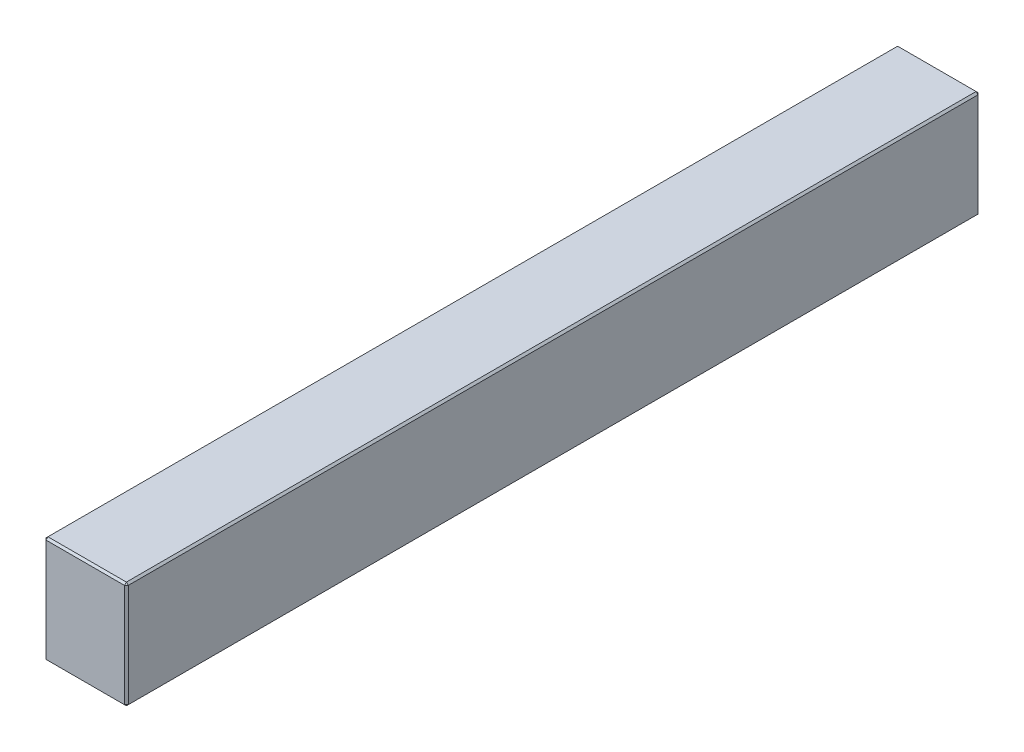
ISO-10303-21;
HEADER;
FILE_DESCRIPTION(('STEP AP214'),'2;1');
FILE_NAME('part.step','',(''),(''),'','','');
FILE_SCHEMA(('AUTOMOTIVE_DESIGN { 1 0 10303 214 1 1 1 1 }'));
ENDSEC;
DATA;
#1=APPLICATION_CONTEXT('core data for automotive mechanical design processes');
#2=APPLICATION_PROTOCOL_DEFINITION('international standard','automotive_design',2000,#1);
#3=PRODUCT_CONTEXT('',#1,'mechanical');
#4=PRODUCT('Part','Part','',(#3));
#5=PRODUCT_RELATED_PRODUCT_CATEGORY('part','',(#4));
#6=PRODUCT_DEFINITION_FORMATION('','',#4);
#7=PRODUCT_DEFINITION_CONTEXT('part definition',#1,'design');
#8=PRODUCT_DEFINITION('design','',#6,#7);
#9=PRODUCT_DEFINITION_SHAPE('','',#8);
#10=(LENGTH_UNIT() NAMED_UNIT(*) SI_UNIT(.MILLI.,.METRE.));
#11=(NAMED_UNIT(*) PLANE_ANGLE_UNIT() SI_UNIT($,.RADIAN.));
#12=(NAMED_UNIT(*) SI_UNIT($,.STERADIAN.) SOLID_ANGLE_UNIT());
#13=UNCERTAINTY_MEASURE_WITH_UNIT(LENGTH_MEASURE(1.E-05),#10,'distance_accuracy_value','');
#14=(GEOMETRIC_REPRESENTATION_CONTEXT(3) GLOBAL_UNCERTAINTY_ASSIGNED_CONTEXT((#13)) GLOBAL_UNIT_ASSIGNED_CONTEXT((#10,
#11,#12)) REPRESENTATION_CONTEXT('',''));
#15=CARTESIAN_POINT('',(0.,0.,0.));
#16=DIRECTION('',(0.,0.,1.));
#17=DIRECTION('',(1.,0.,0.));
#18=AXIS2_PLACEMENT_3D('',#15,#16,#17);
#19=CARTESIAN_POINT('',(-21.5,56.,223.));
#20=DIRECTION('',(1.,0.,0.));
#21=DIRECTION('',(0.,0.,-1.));
#22=AXIS2_PLACEMENT_3D('',#19,#20,#21);
#23=PLANE('',#22);
#24=DIRECTION('',(0.,-1.,0.));
#25=VECTOR('',#24,1.);
#26=CARTESIAN_POINT('',(-21.5,56.,-222.));
#27=LINE('',#26,#25);
#28=CARTESIAN_POINT('',(-21.5,55.,-222.));
#29=VERTEX_POINT('',#28);
#30=CARTESIAN_POINT('',(-21.5,1.,-222.));
#31=VERTEX_POINT('',#30);
#32=EDGE_CURVE('E114',#29,#31,#27,.T.);
#33=ORIENTED_EDGE('',*,*,#32,.T.);
#34=DIRECTION('',(0.,0.,1.));
#35=VECTOR('',#34,1.);
#36=CARTESIAN_POINT('',(-21.5,1.,223.));
#37=LINE('',#36,#35);
#38=CARTESIAN_POINT('',(-21.5,1.,222.));
#39=VERTEX_POINT('',#38);
#40=EDGE_CURVE('E110',#31,#39,#37,.T.);
#41=ORIENTED_EDGE('',*,*,#40,.T.);
#42=DIRECTION('',(0.,1.,0.));
#43=VECTOR('',#42,1.);
#44=CARTESIAN_POINT('',(-21.5,56.,222.));
#45=LINE('',#44,#43);
#46=CARTESIAN_POINT('',(-21.5,55.,222.));
#47=VERTEX_POINT('',#46);
#48=EDGE_CURVE('E103',#39,#47,#45,.T.);
#49=ORIENTED_EDGE('',*,*,#48,.T.);
#50=DIRECTION('',(0.,0.,-1.));
#51=VECTOR('',#50,1.);
#52=CARTESIAN_POINT('',(-21.5,55.,-223.));
#53=LINE('',#52,#51);
#54=EDGE_CURVE('E107',#47,#29,#53,.T.);
#55=ORIENTED_EDGE('',*,*,#54,.T.);
#56=EDGE_LOOP('',(#33,#41,#49,#55));
#57=FACE_BOUND('',#56,.T.);
#58=ADVANCED_FACE('F15',(#57),#23,.F.);
#59=CARTESIAN_POINT('',(21.5,56.,223.));
#60=DIRECTION('',(0.,0.,-1.));
#61=DIRECTION('',(-1.,0.,0.));
#62=AXIS2_PLACEMENT_3D('',#59,#60,#61);
#63=PLANE('',#62);
#64=DIRECTION('',(-1.,0.,0.));
#65=VECTOR('',#64,1.);
#66=CARTESIAN_POINT('',(-21.5,55.,223.));
#67=LINE('',#66,#65);
#68=CARTESIAN_POINT('',(20.5,55.,223.));
#69=VERTEX_POINT('',#68);
#70=CARTESIAN_POINT('',(-20.5,55.,223.));
#71=VERTEX_POINT('',#70);
#72=EDGE_CURVE('E164',#69,#71,#67,.T.);
#73=ORIENTED_EDGE('',*,*,#72,.T.);
#74=DIRECTION('',(0.,-1.,0.));
#75=VECTOR('',#74,1.);
#76=CARTESIAN_POINT('',(-20.5,56.,223.));
#77=LINE('',#76,#75);
#78=CARTESIAN_POINT('',(-20.5,1.,223.));
#79=VERTEX_POINT('',#78);
#80=EDGE_CURVE('E122',#71,#79,#77,.T.);
#81=ORIENTED_EDGE('',*,*,#80,.T.);
#82=DIRECTION('',(1.,0.,0.));
#83=VECTOR('',#82,1.);
#84=CARTESIAN_POINT('',(21.5,1.,223.));
#85=LINE('',#84,#83);
#86=CARTESIAN_POINT('',(20.5,1.,223.));
#87=VERTEX_POINT('',#86);
#88=EDGE_CURVE('E168',#79,#87,#85,.T.);
#89=ORIENTED_EDGE('',*,*,#88,.T.);
#90=DIRECTION('',(0.,1.,0.));
#91=VECTOR('',#90,1.);
#92=CARTESIAN_POINT('',(20.5,56.,223.));
#93=LINE('',#92,#91);
#94=EDGE_CURVE('E166',#87,#69,#93,.T.);
#95=ORIENTED_EDGE('',*,*,#94,.T.);
#96=EDGE_LOOP('',(#73,#81,#89,#95));
#97=FACE_BOUND('',#96,.T.);
#98=ADVANCED_FACE('F275',(#97),#63,.F.);
#99=CARTESIAN_POINT('',(21.5,56.,223.));
#100=DIRECTION('',(-1.,0.,0.));
#101=DIRECTION('',(0.,0.,1.));
#102=AXIS2_PLACEMENT_3D('',#99,#100,#101);
#103=PLANE('',#102);
#104=DIRECTION('',(0.,0.,-1.));
#105=VECTOR('',#104,1.);
#106=CARTESIAN_POINT('',(21.5,1.,223.));
#107=LINE('',#106,#105);
#108=CARTESIAN_POINT('',(21.5,1.,222.));
#109=VERTEX_POINT('',#108);
#110=CARTESIAN_POINT('',(21.5,1.,-222.));
#111=VERTEX_POINT('',#110);
#112=EDGE_CURVE('E159',#109,#111,#107,.T.);
#113=ORIENTED_EDGE('',*,*,#112,.T.);
#114=DIRECTION('',(0.,1.,0.));
#115=VECTOR('',#114,1.);
#116=CARTESIAN_POINT('',(21.5,56.,-222.));
#117=LINE('',#116,#115);
#118=CARTESIAN_POINT('',(21.5,55.,-222.));
#119=VERTEX_POINT('',#118);
#120=EDGE_CURVE('E161',#111,#119,#117,.T.);
#121=ORIENTED_EDGE('',*,*,#120,.T.);
#122=DIRECTION('',(0.,0.,1.));
#123=VECTOR('',#122,1.);
#124=CARTESIAN_POINT('',(21.5,55.,223.));
#125=LINE('',#124,#123);
#126=CARTESIAN_POINT('',(21.5,55.,222.));
#127=VERTEX_POINT('',#126);
#128=EDGE_CURVE('E155',#119,#127,#125,.T.);
#129=ORIENTED_EDGE('',*,*,#128,.T.);
#130=DIRECTION('',(0.,-1.,0.));
#131=VECTOR('',#130,1.);
#132=CARTESIAN_POINT('',(21.5,56.,222.));
#133=LINE('',#132,#131);
#134=EDGE_CURVE('E157',#127,#109,#133,.T.);
#135=ORIENTED_EDGE('',*,*,#134,.T.);
#136=EDGE_LOOP('',(#113,#121,#129,#135));
#137=FACE_BOUND('',#136,.T.);
#138=ADVANCED_FACE('F254',(#137),#103,.F.);
#139=CARTESIAN_POINT('',(21.5,56.,-223.));
#140=DIRECTION('',(0.,0.,1.));
#141=DIRECTION('',(1.,0.,0.));
#142=AXIS2_PLACEMENT_3D('',#139,#140,#141);
#143=PLANE('',#142);
#144=DIRECTION('',(0.,-1.,0.));
#145=VECTOR('',#144,1.);
#146=CARTESIAN_POINT('',(20.5,56.,-223.));
#147=LINE('',#146,#145);
#148=CARTESIAN_POINT('',(20.5,55.,-223.));
#149=VERTEX_POINT('',#148);
#150=CARTESIAN_POINT('',(20.5,1.,-223.));
#151=VERTEX_POINT('',#150);
#152=EDGE_CURVE('E148',#149,#151,#147,.T.);
#153=ORIENTED_EDGE('',*,*,#152,.T.);
#154=DIRECTION('',(-1.,0.,0.));
#155=VECTOR('',#154,1.);
#156=CARTESIAN_POINT('',(21.5,1.,-223.));
#157=LINE('',#156,#155);
#158=CARTESIAN_POINT('',(-20.5,1.,-223.));
#159=VERTEX_POINT('',#158);
#160=EDGE_CURVE('E153',#151,#159,#157,.T.);
#161=ORIENTED_EDGE('',*,*,#160,.T.);
#162=DIRECTION('',(0.,1.,0.));
#163=VECTOR('',#162,1.);
#164=CARTESIAN_POINT('',(-20.5,56.,-223.));
#165=LINE('',#164,#163);
#166=CARTESIAN_POINT('',(-20.5,55.,-223.));
#167=VERTEX_POINT('',#166);
#168=EDGE_CURVE('E150',#159,#167,#165,.T.);
#169=ORIENTED_EDGE('',*,*,#168,.T.);
#170=DIRECTION('',(1.,0.,0.));
#171=VECTOR('',#170,1.);
#172=CARTESIAN_POINT('',(21.5,55.,-223.));
#173=LINE('',#172,#171);
#174=EDGE_CURVE('E146',#167,#149,#173,.T.);
#175=ORIENTED_EDGE('',*,*,#174,.T.);
#176=EDGE_LOOP('',(#153,#161,#169,#175));
#177=FACE_BOUND('',#176,.T.);
#178=ADVANCED_FACE('F284',(#177),#143,.F.);
#179=CARTESIAN_POINT('',(0.,56.,0.));
#180=DIRECTION('',(0.,1.,0.));
#181=DIRECTION('',(0.,0.,1.));
#182=AXIS2_PLACEMENT_3D('',#179,#180,#181);
#183=PLANE('',#182);
#184=DIRECTION('',(0.,0.,-1.));
#185=VECTOR('',#184,1.);
#186=CARTESIAN_POINT('',(20.5,56.,-223.));
#187=LINE('',#186,#185);
#188=CARTESIAN_POINT('',(20.5,56.,222.));
#189=VERTEX_POINT('',#188);
#190=CARTESIAN_POINT('',(20.5,56.,-222.));
#191=VERTEX_POINT('',#190);
#192=EDGE_CURVE('E24',#189,#191,#187,.T.);
#193=ORIENTED_EDGE('',*,*,#192,.T.);
#194=DIRECTION('',(-1.,0.,0.));
#195=VECTOR('',#194,1.);
#196=CARTESIAN_POINT('',(-21.5,56.,-222.));
#197=LINE('',#196,#195);
#198=CARTESIAN_POINT('',(-20.5,56.,-222.));
#199=VERTEX_POINT('',#198);
#200=EDGE_CURVE('E9',#191,#199,#197,.T.);
#201=ORIENTED_EDGE('',*,*,#200,.T.);
#202=DIRECTION('',(0.,0.,1.));
#203=VECTOR('',#202,1.);
#204=CARTESIAN_POINT('',(-20.5,56.,223.));
#205=LINE('',#204,#203);
#206=CARTESIAN_POINT('',(-20.5,56.,222.));
#207=VERTEX_POINT('',#206);
#208=EDGE_CURVE('E180',#199,#207,#205,.T.);
#209=ORIENTED_EDGE('',*,*,#208,.T.);
#210=DIRECTION('',(1.,0.,0.));
#211=VECTOR('',#210,1.);
#212=CARTESIAN_POINT('',(21.5,56.,222.));
#213=LINE('',#212,#211);
#214=EDGE_CURVE('E35',#207,#189,#213,.T.);
#215=ORIENTED_EDGE('',*,*,#214,.T.);
#216=EDGE_LOOP('',(#193,#201,#209,#215));
#217=FACE_BOUND('',#216,.T.);
#218=ADVANCED_FACE('F350',(#217),#183,.T.);
#219=CARTESIAN_POINT('',(0.,0.,0.));
#220=DIRECTION('',(0.,1.,0.));
#221=DIRECTION('',(0.,0.,1.));
#222=AXIS2_PLACEMENT_3D('',#219,#220,#221);
#223=PLANE('',#222);
#224=DIRECTION('',(0.,0.,1.));
#225=VECTOR('',#224,1.);
#226=CARTESIAN_POINT('',(20.5,0.,0.));
#227=LINE('',#226,#225);
#228=CARTESIAN_POINT('',(20.5,0.,-222.));
#229=VERTEX_POINT('',#228);
#230=CARTESIAN_POINT('',(20.5,0.,222.));
#231=VERTEX_POINT('',#230);
#232=EDGE_CURVE('E171',#229,#231,#227,.T.);
#233=ORIENTED_EDGE('',*,*,#232,.T.);
#234=DIRECTION('',(-1.,0.,0.));
#235=VECTOR('',#234,1.);
#236=CARTESIAN_POINT('',(0.,0.,222.));
#237=LINE('',#236,#235);
#238=CARTESIAN_POINT('',(-20.5,0.,222.));
#239=VERTEX_POINT('',#238);
#240=EDGE_CURVE('E177',#231,#239,#237,.T.);
#241=ORIENTED_EDGE('',*,*,#240,.T.);
#242=DIRECTION('',(0.,0.,-1.));
#243=VECTOR('',#242,1.);
#244=CARTESIAN_POINT('',(-20.5,0.,0.));
#245=LINE('',#244,#243);
#246=CARTESIAN_POINT('',(-20.5,0.,-222.));
#247=VERTEX_POINT('',#246);
#248=EDGE_CURVE('E175',#239,#247,#245,.T.);
#249=ORIENTED_EDGE('',*,*,#248,.T.);
#250=DIRECTION('',(1.,0.,0.));
#251=VECTOR('',#250,1.);
#252=CARTESIAN_POINT('',(0.,0.,-222.));
#253=LINE('',#252,#251);
#254=EDGE_CURVE('E173',#247,#229,#253,.T.);
#255=ORIENTED_EDGE('',*,*,#254,.T.);
#256=EDGE_LOOP('',(#233,#241,#249,#255));
#257=FACE_BOUND('',#256,.T.);
#258=ADVANCED_FACE('F246',(#257),#223,.F.);
#259=CARTESIAN_POINT('',(21.5,56.,222.));
#260=DIRECTION('',(-0.707106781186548,0.,-0.707106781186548));
#261=DIRECTION('',(0.,-1.,0.));
#262=AXIS2_PLACEMENT_3D('',#259,#260,#261);
#263=PLANE('',#262);
#264=DIRECTION('',(-0.707106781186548,0.,0.707106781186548));
#265=VECTOR('',#264,1.);
#266=CARTESIAN_POINT('',(20.5,55.,223.));
#267=LINE('',#266,#265);
#268=EDGE_CURVE('E19',#69,#127,#267,.F.);
#269=ORIENTED_EDGE('',*,*,#268,.F.);
#270=ORIENTED_EDGE('',*,*,#94,.F.);
#271=DIRECTION('',(0.707106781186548,0.,-0.707106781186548));
#272=VECTOR('',#271,1.);
#273=CARTESIAN_POINT('',(20.5,1.,223.));
#274=LINE('',#273,#272);
#275=EDGE_CURVE('E142',#109,#87,#274,.F.);
#276=ORIENTED_EDGE('',*,*,#275,.F.);
#277=ORIENTED_EDGE('',*,*,#134,.F.);
#278=EDGE_LOOP('',(#269,#270,#276,#277));
#279=FACE_BOUND('',#278,.T.);
#280=ADVANCED_FACE('F17',(#279),#263,.F.);
#281=CARTESIAN_POINT('',(20.5,55.,223.));
#282=DIRECTION('',(0.577350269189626,0.577350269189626,0.577350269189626));
#283=DIRECTION('',(0.707106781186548,0.,-0.707106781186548));
#284=AXIS2_PLACEMENT_3D('',#281,#282,#283);
#285=PLANE('',#284);
#286=DIRECTION('',(0.,-0.707106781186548,0.707106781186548));
#287=VECTOR('',#286,1.);
#288=CARTESIAN_POINT('',(20.5,55.,223.));
#289=LINE('',#288,#287);
#290=EDGE_CURVE('E226',#69,#189,#289,.F.);
#291=ORIENTED_EDGE('',*,*,#290,.F.);
#292=ORIENTED_EDGE('',*,*,#268,.T.);
#293=DIRECTION('',(-0.707106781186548,0.707106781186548,0.));
#294=VECTOR('',#293,1.);
#295=CARTESIAN_POINT('',(21.,55.5,222.));
#296=LINE('',#295,#294);
#297=EDGE_CURVE('E228',#189,#127,#296,.F.);
#298=ORIENTED_EDGE('',*,*,#297,.F.);
#299=EDGE_LOOP('',(#291,#292,#298));
#300=FACE_BOUND('',#299,.T.);
#301=ADVANCED_FACE('F270',(#300),#285,.T.);
#302=CARTESIAN_POINT('',(20.5,1.,223.));
#303=DIRECTION('',(0.577350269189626,-0.577350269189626,0.577350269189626));
#304=DIRECTION('',(0.707106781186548,0.,-0.707106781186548));
#305=AXIS2_PLACEMENT_3D('',#302,#303,#304);
#306=PLANE('',#305);
#307=DIRECTION('',(-0.707106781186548,-0.707106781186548,0.));
#308=VECTOR('',#307,1.);
#309=CARTESIAN_POINT('',(21.,0.5,222.));
#310=LINE('',#309,#308);
#311=EDGE_CURVE('E220',#109,#231,#310,.T.);
#312=ORIENTED_EDGE('',*,*,#311,.F.);
#313=ORIENTED_EDGE('',*,*,#275,.T.);
#314=DIRECTION('',(0.,0.707106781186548,0.707106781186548));
#315=VECTOR('',#314,1.);
#316=CARTESIAN_POINT('',(20.5,1.,223.));
#317=LINE('',#316,#315);
#318=EDGE_CURVE('E223',#231,#87,#317,.T.);
#319=ORIENTED_EDGE('',*,*,#318,.F.);
#320=EDGE_LOOP('',(#312,#313,#319));
#321=FACE_BOUND('',#320,.T.);
#322=ADVANCED_FACE('F235',(#321),#306,.T.);
#323=CARTESIAN_POINT('',(20.5,56.,0.));
#324=DIRECTION('',(0.707106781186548,0.707106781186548,0.));
#325=DIRECTION('',(0.,0.,1.));
#326=AXIS2_PLACEMENT_3D('',#323,#324,#325);
#327=PLANE('',#326);
#328=ORIENTED_EDGE('',*,*,#297,.T.);
#329=ORIENTED_EDGE('',*,*,#128,.F.);
#330=DIRECTION('',(0.707106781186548,-0.707106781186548,0.));
#331=VECTOR('',#330,1.);
#332=CARTESIAN_POINT('',(21.5,55.,-222.));
#333=LINE('',#332,#331);
#334=EDGE_CURVE('E215',#191,#119,#333,.T.);
#335=ORIENTED_EDGE('',*,*,#334,.F.);
#336=ORIENTED_EDGE('',*,*,#192,.F.);
#337=EDGE_LOOP('',(#328,#329,#335,#336));
#338=FACE_BOUND('',#337,.T.);
#339=ADVANCED_FACE('F265',(#338),#327,.T.);
#340=CARTESIAN_POINT('',(0.,56.,222.));
#341=DIRECTION('',(0.,0.707106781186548,0.707106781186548));
#342=DIRECTION('',(-1.,0.,0.));
#343=AXIS2_PLACEMENT_3D('',#340,#341,#342);
#344=PLANE('',#343);
#345=ORIENTED_EDGE('',*,*,#290,.T.);
#346=ORIENTED_EDGE('',*,*,#214,.F.);
#347=DIRECTION('',(0.,0.707106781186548,-0.707106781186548));
#348=VECTOR('',#347,1.);
#349=CARTESIAN_POINT('',(-20.5,55.5,222.5));
#350=LINE('',#349,#348);
#351=EDGE_CURVE('E126',#71,#207,#350,.T.);
#352=ORIENTED_EDGE('',*,*,#351,.F.);
#353=ORIENTED_EDGE('',*,*,#72,.F.);
#354=EDGE_LOOP('',(#345,#346,#352,#353));
#355=FACE_BOUND('',#354,.T.);
#356=ADVANCED_FACE('F273',(#355),#344,.T.);
#357=CARTESIAN_POINT('',(-20.5,56.,223.));
#358=DIRECTION('',(0.707106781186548,0.,-0.707106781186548));
#359=DIRECTION('',(0.,-1.,0.));
#360=AXIS2_PLACEMENT_3D('',#357,#358,#359);
#361=PLANE('',#360);
#362=DIRECTION('',(0.707106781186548,0.,0.707106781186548));
#363=VECTOR('',#362,1.);
#364=CARTESIAN_POINT('',(-20.5,1.,223.));
#365=LINE('',#364,#363);
#366=EDGE_CURVE('E127',#79,#39,#365,.F.);
#367=ORIENTED_EDGE('',*,*,#366,.F.);
#368=ORIENTED_EDGE('',*,*,#80,.F.);
#369=DIRECTION('',(-0.707106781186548,0.,-0.707106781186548));
#370=VECTOR('',#369,1.);
#371=CARTESIAN_POINT('',(-21.5,55.,222.));
#372=LINE('',#371,#370);
#373=EDGE_CURVE('E118',#47,#71,#372,.F.);
#374=ORIENTED_EDGE('',*,*,#373,.F.);
#375=ORIENTED_EDGE('',*,*,#48,.F.);
#376=EDGE_LOOP('',(#367,#368,#374,#375));
#377=FACE_BOUND('',#376,.T.);
#378=ADVANCED_FACE('F120',(#377),#361,.F.);
#379=CARTESIAN_POINT('',(21.5,1.,223.));
#380=DIRECTION('',(0.,0.707106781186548,-0.707106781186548));
#381=DIRECTION('',(1.,0.,0.));
#382=AXIS2_PLACEMENT_3D('',#379,#380,#381);
#383=PLANE('',#382);
#384=ORIENTED_EDGE('',*,*,#318,.T.);
#385=ORIENTED_EDGE('',*,*,#88,.F.);
#386=DIRECTION('',(0.,-0.707106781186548,-0.707106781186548));
#387=VECTOR('',#386,1.);
#388=CARTESIAN_POINT('',(-20.5,1.,223.));
#389=LINE('',#388,#387);
#390=EDGE_CURVE('E211',#239,#79,#389,.F.);
#391=ORIENTED_EDGE('',*,*,#390,.F.);
#392=ORIENTED_EDGE('',*,*,#240,.F.);
#393=EDGE_LOOP('',(#384,#385,#391,#392));
#394=FACE_BOUND('',#393,.T.);
#395=ADVANCED_FACE('F243',(#394),#383,.F.);
#396=CARTESIAN_POINT('',(21.5,1.,223.));
#397=DIRECTION('',(-0.707106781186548,0.707106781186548,0.));
#398=DIRECTION('',(0.,0.,-1.));
#399=AXIS2_PLACEMENT_3D('',#396,#397,#398);
#400=PLANE('',#399);
#401=ORIENTED_EDGE('',*,*,#311,.T.);
#402=ORIENTED_EDGE('',*,*,#232,.F.);
#403=DIRECTION('',(0.707106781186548,0.707106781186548,0.));
#404=VECTOR('',#403,1.);
#405=CARTESIAN_POINT('',(21.,0.5,-222.));
#406=LINE('',#405,#404);
#407=EDGE_CURVE('E208',#111,#229,#406,.F.);
#408=ORIENTED_EDGE('',*,*,#407,.F.);
#409=ORIENTED_EDGE('',*,*,#112,.F.);
#410=EDGE_LOOP('',(#401,#402,#408,#409));
#411=FACE_BOUND('',#410,.T.);
#412=ADVANCED_FACE('F251',(#411),#400,.F.);
#413=CARTESIAN_POINT('',(20.5,56.,-223.));
#414=DIRECTION('',(-0.707106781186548,0.,0.707106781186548));
#415=DIRECTION('',(0.,-1.,0.));
#416=AXIS2_PLACEMENT_3D('',#413,#414,#415);
#417=PLANE('',#416);
#418=DIRECTION('',(0.707106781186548,0.,0.707106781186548));
#419=VECTOR('',#418,1.);
#420=CARTESIAN_POINT('',(21.5,55.,-222.));
#421=LINE('',#420,#419);
#422=EDGE_CURVE('E217',#119,#149,#421,.F.);
#423=ORIENTED_EDGE('',*,*,#422,.F.);
#424=ORIENTED_EDGE('',*,*,#120,.F.);
#425=DIRECTION('',(-0.707106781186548,0.,-0.707106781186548));
#426=VECTOR('',#425,1.);
#427=CARTESIAN_POINT('',(20.5,1.,-223.));
#428=LINE('',#427,#426);
#429=EDGE_CURVE('E205',#151,#111,#428,.F.);
#430=ORIENTED_EDGE('',*,*,#429,.F.);
#431=ORIENTED_EDGE('',*,*,#152,.F.);
#432=EDGE_LOOP('',(#423,#424,#430,#431));
#433=FACE_BOUND('',#432,.T.);
#434=ADVANCED_FACE('F258',(#433),#417,.F.);
#435=CARTESIAN_POINT('',(21.5,55.,-222.));
#436=DIRECTION('',(0.577350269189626,0.577350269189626,-0.577350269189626));
#437=DIRECTION('',(-0.707106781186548,0.,-0.707106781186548));
#438=AXIS2_PLACEMENT_3D('',#435,#436,#437);
#439=PLANE('',#438);
#440=ORIENTED_EDGE('',*,*,#334,.T.);
#441=ORIENTED_EDGE('',*,*,#422,.T.);
#442=DIRECTION('',(0.,0.707106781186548,0.707106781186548));
#443=VECTOR('',#442,1.);
#444=CARTESIAN_POINT('',(20.5,55.5,-222.5));
#445=LINE('',#444,#443);
#446=EDGE_CURVE('E134',#191,#149,#445,.F.);
#447=ORIENTED_EDGE('',*,*,#446,.F.);
#448=EDGE_LOOP('',(#440,#441,#447));
#449=FACE_BOUND('',#448,.T.);
#450=ADVANCED_FACE('F325',(#449),#439,.T.);
#451=CARTESIAN_POINT('',(-21.5,55.,222.));
#452=DIRECTION('',(-0.577350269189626,0.577350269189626,0.577350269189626));
#453=DIRECTION('',(0.707106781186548,0.,0.707106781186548));
#454=AXIS2_PLACEMENT_3D('',#451,#452,#453);
#455=PLANE('',#454);
#456=ORIENTED_EDGE('',*,*,#373,.T.);
#457=ORIENTED_EDGE('',*,*,#351,.T.);
#458=DIRECTION('',(-0.707106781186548,-0.707106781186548,0.));
#459=VECTOR('',#458,1.);
#460=CARTESIAN_POINT('',(-21.5,55.,222.));
#461=LINE('',#460,#459);
#462=EDGE_CURVE('E130',#47,#207,#461,.F.);
#463=ORIENTED_EDGE('',*,*,#462,.F.);
#464=EDGE_LOOP('',(#456,#457,#463));
#465=FACE_BOUND('',#464,.T.);
#466=ADVANCED_FACE('F131',(#465),#455,.T.);
#467=CARTESIAN_POINT('',(-20.5,1.,223.));
#468=DIRECTION('',(-0.577350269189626,-0.577350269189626,0.577350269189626));
#469=DIRECTION('',(0.707106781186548,0.,0.707106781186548));
#470=AXIS2_PLACEMENT_3D('',#467,#468,#469);
#471=PLANE('',#470);
#472=ORIENTED_EDGE('',*,*,#390,.T.);
#473=ORIENTED_EDGE('',*,*,#366,.T.);
#474=DIRECTION('',(-0.707106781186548,0.707106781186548,0.));
#475=VECTOR('',#474,1.);
#476=CARTESIAN_POINT('',(-21.,0.5,222.));
#477=LINE('',#476,#475);
#478=EDGE_CURVE('E135',#239,#39,#477,.T.);
#479=ORIENTED_EDGE('',*,*,#478,.F.);
#480=EDGE_LOOP('',(#472,#473,#479));
#481=FACE_BOUND('',#480,.T.);
#482=ADVANCED_FACE('F318',(#481),#471,.T.);
#483=CARTESIAN_POINT('',(20.5,1.,-223.));
#484=DIRECTION('',(0.577350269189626,-0.577350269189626,-0.577350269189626));
#485=DIRECTION('',(-0.707106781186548,0.,-0.707106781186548));
#486=AXIS2_PLACEMENT_3D('',#483,#484,#485);
#487=PLANE('',#486);
#488=ORIENTED_EDGE('',*,*,#429,.T.);
#489=ORIENTED_EDGE('',*,*,#407,.T.);
#490=DIRECTION('',(0.,-0.707106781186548,0.707106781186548));
#491=VECTOR('',#490,1.);
#492=CARTESIAN_POINT('',(20.5,1.,-223.));
#493=LINE('',#492,#491);
#494=EDGE_CURVE('E198',#151,#229,#493,.T.);
#495=ORIENTED_EDGE('',*,*,#494,.F.);
#496=EDGE_LOOP('',(#488,#489,#495));
#497=FACE_BOUND('',#496,.T.);
#498=ADVANCED_FACE('F314',(#497),#487,.T.);
#499=CARTESIAN_POINT('',(0.,56.,-222.));
#500=DIRECTION('',(0.,0.707106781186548,-0.707106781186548));
#501=DIRECTION('',(1.,0.,0.));
#502=AXIS2_PLACEMENT_3D('',#499,#500,#501);
#503=PLANE('',#502);
#504=ORIENTED_EDGE('',*,*,#446,.T.);
#505=ORIENTED_EDGE('',*,*,#174,.F.);
#506=DIRECTION('',(0.,-0.707106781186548,-0.707106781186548));
#507=VECTOR('',#506,1.);
#508=CARTESIAN_POINT('',(-20.5,55.,-223.));
#509=LINE('',#508,#507);
#510=EDGE_CURVE('E195',#199,#167,#509,.T.);
#511=ORIENTED_EDGE('',*,*,#510,.F.);
#512=ORIENTED_EDGE('',*,*,#200,.F.);
#513=EDGE_LOOP('',(#504,#505,#511,#512));
#514=FACE_BOUND('',#513,.T.);
#515=ADVANCED_FACE('F311',(#514),#503,.T.);
#516=CARTESIAN_POINT('',(-20.5,56.,0.));
#517=DIRECTION('',(-0.707106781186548,0.707106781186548,0.));
#518=DIRECTION('',(0.,0.,-1.));
#519=AXIS2_PLACEMENT_3D('',#516,#517,#518);
#520=PLANE('',#519);
#521=ORIENTED_EDGE('',*,*,#462,.T.);
#522=ORIENTED_EDGE('',*,*,#208,.F.);
#523=DIRECTION('',(0.707106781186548,0.707106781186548,0.));
#524=VECTOR('',#523,1.);
#525=CARTESIAN_POINT('',(-21.,55.5,-222.));
#526=LINE('',#525,#524);
#527=EDGE_CURVE('E138',#29,#199,#526,.T.);
#528=ORIENTED_EDGE('',*,*,#527,.F.);
#529=ORIENTED_EDGE('',*,*,#54,.F.);
#530=EDGE_LOOP('',(#521,#522,#528,#529));
#531=FACE_BOUND('',#530,.T.);
#532=ADVANCED_FACE('F137',(#531),#520,.T.);
#533=CARTESIAN_POINT('',(-21.5,1.,223.));
#534=DIRECTION('',(0.707106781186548,0.707106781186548,0.));
#535=DIRECTION('',(0.,0.,1.));
#536=AXIS2_PLACEMENT_3D('',#533,#534,#535);
#537=PLANE('',#536);
#538=ORIENTED_EDGE('',*,*,#478,.T.);
#539=ORIENTED_EDGE('',*,*,#40,.F.);
#540=DIRECTION('',(0.707106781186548,-0.707106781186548,0.));
#541=VECTOR('',#540,1.);
#542=CARTESIAN_POINT('',(-21.5,1.,-222.));
#543=LINE('',#542,#541);
#544=EDGE_CURVE('E191',#247,#31,#543,.F.);
#545=ORIENTED_EDGE('',*,*,#544,.F.);
#546=ORIENTED_EDGE('',*,*,#248,.F.);
#547=EDGE_LOOP('',(#538,#539,#545,#546));
#548=FACE_BOUND('',#547,.T.);
#549=ADVANCED_FACE('F304',(#548),#537,.F.);
#550=CARTESIAN_POINT('',(21.5,1.,-223.));
#551=DIRECTION('',(0.,0.707106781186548,0.707106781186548));
#552=DIRECTION('',(-1.,0.,0.));
#553=AXIS2_PLACEMENT_3D('',#550,#551,#552);
#554=PLANE('',#553);
#555=ORIENTED_EDGE('',*,*,#494,.T.);
#556=ORIENTED_EDGE('',*,*,#254,.F.);
#557=DIRECTION('',(0.,0.707106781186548,-0.707106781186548));
#558=VECTOR('',#557,1.);
#559=CARTESIAN_POINT('',(-20.5,0.5,-222.5));
#560=LINE('',#559,#558);
#561=EDGE_CURVE('E188',#159,#247,#560,.F.);
#562=ORIENTED_EDGE('',*,*,#561,.F.);
#563=ORIENTED_EDGE('',*,*,#160,.F.);
#564=EDGE_LOOP('',(#555,#556,#562,#563));
#565=FACE_BOUND('',#564,.T.);
#566=ADVANCED_FACE('F300',(#565),#554,.F.);
#567=CARTESIAN_POINT('',(-20.5,55.,-223.));
#568=DIRECTION('',(-0.577350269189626,0.577350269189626,-0.577350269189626));
#569=DIRECTION('',(-0.707106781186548,0.,0.707106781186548));
#570=AXIS2_PLACEMENT_3D('',#567,#568,#569);
#571=PLANE('',#570);
#572=ORIENTED_EDGE('',*,*,#527,.T.);
#573=ORIENTED_EDGE('',*,*,#510,.T.);
#574=DIRECTION('',(0.707106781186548,0.,-0.707106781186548));
#575=VECTOR('',#574,1.);
#576=CARTESIAN_POINT('',(-20.5,55.,-223.));
#577=LINE('',#576,#575);
#578=EDGE_CURVE('E186',#29,#167,#577,.T.);
#579=ORIENTED_EDGE('',*,*,#578,.F.);
#580=EDGE_LOOP('',(#572,#573,#579));
#581=FACE_BOUND('',#580,.T.);
#582=ADVANCED_FACE('F296',(#581),#571,.T.);
#583=CARTESIAN_POINT('',(-21.5,1.,-222.));
#584=DIRECTION('',(-0.577350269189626,-0.577350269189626,-0.577350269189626));
#585=DIRECTION('',(-0.707106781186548,0.,0.707106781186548));
#586=AXIS2_PLACEMENT_3D('',#583,#584,#585);
#587=PLANE('',#586);
#588=ORIENTED_EDGE('',*,*,#561,.T.);
#589=ORIENTED_EDGE('',*,*,#544,.T.);
#590=DIRECTION('',(-0.707106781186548,0.,0.707106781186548));
#591=VECTOR('',#590,1.);
#592=CARTESIAN_POINT('',(-21.5,1.,-222.));
#593=LINE('',#592,#591);
#594=EDGE_CURVE('E184',#159,#31,#593,.T.);
#595=ORIENTED_EDGE('',*,*,#594,.F.);
#596=EDGE_LOOP('',(#588,#589,#595));
#597=FACE_BOUND('',#596,.T.);
#598=ADVANCED_FACE('F292',(#597),#587,.T.);
#599=CARTESIAN_POINT('',(-21.5,56.,-222.));
#600=DIRECTION('',(0.707106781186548,0.,0.707106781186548));
#601=DIRECTION('',(0.,-1.,0.));
#602=AXIS2_PLACEMENT_3D('',#599,#600,#601);
#603=PLANE('',#602);
#604=ORIENTED_EDGE('',*,*,#578,.T.);
#605=ORIENTED_EDGE('',*,*,#168,.F.);
#606=ORIENTED_EDGE('',*,*,#594,.T.);
#607=ORIENTED_EDGE('',*,*,#32,.F.);
#608=EDGE_LOOP('',(#604,#605,#606,#607));
#609=FACE_BOUND('',#608,.T.);
#610=ADVANCED_FACE('F289',(#609),#603,.F.);
#611=CLOSED_SHELL('',(#58,#98,#138,#178,#218,#258,#280,#301,#322,#339,#356,#378,#395,#412,#434,
#450,#466,#482,#498,#515,#532,#549,#566,#582,#598,#610));
#612=MANIFOLD_SOLID_BREP('B1',#611);
#613=ADVANCED_BREP_SHAPE_REPRESENTATION('',(#18,#612),#14);
#614=SHAPE_DEFINITION_REPRESENTATION(#9,#613);
ENDSEC;
END-ISO-10303-21;
